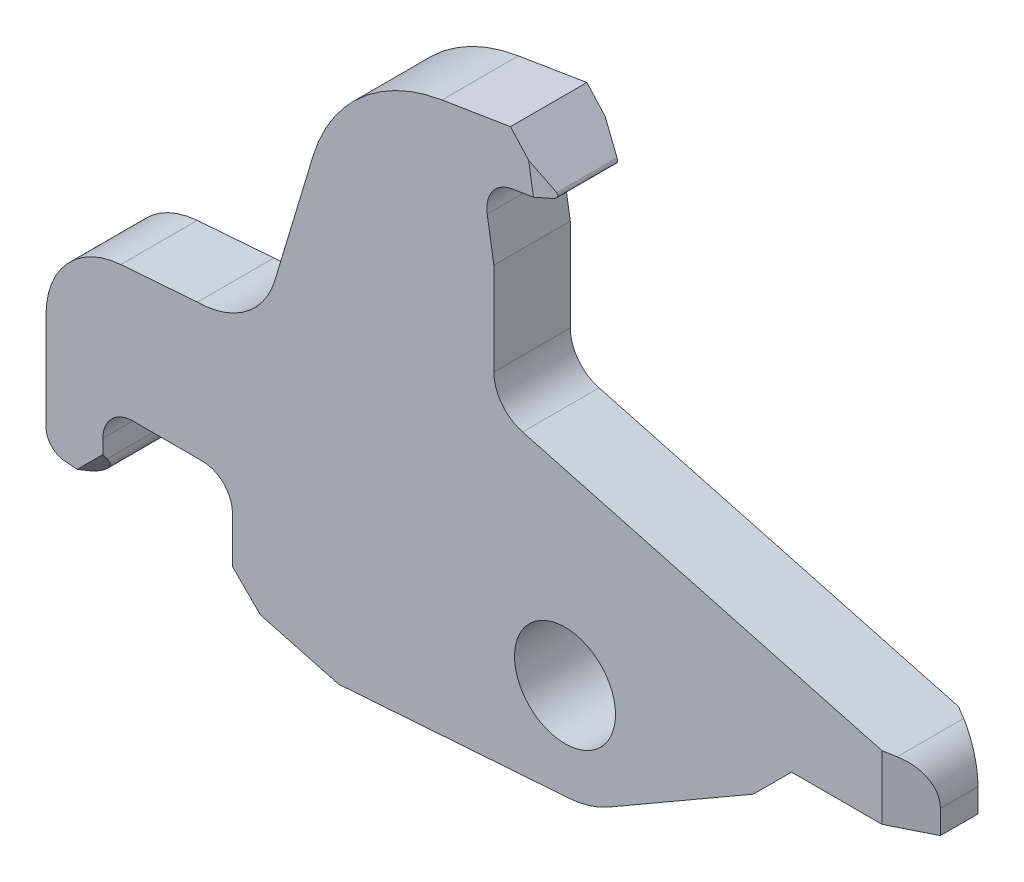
ISO-10303-21;
HEADER;
FILE_DESCRIPTION(('STEP AP214'),'2;1');
FILE_NAME('part.step','',(''),(''),'','','');
FILE_SCHEMA(('AUTOMOTIVE_DESIGN { 1 0 10303 214 1 1 1 1 }'));
ENDSEC;
DATA;
#1=APPLICATION_CONTEXT('core data for automotive mechanical design processes');
#2=APPLICATION_PROTOCOL_DEFINITION('international standard','automotive_design',2000,#1);
#3=PRODUCT_CONTEXT('',#1,'mechanical');
#4=PRODUCT('Part','Part','',(#3));
#5=PRODUCT_RELATED_PRODUCT_CATEGORY('part','',(#4));
#6=PRODUCT_DEFINITION_FORMATION('','',#4);
#7=PRODUCT_DEFINITION_CONTEXT('part definition',#1,'design');
#8=PRODUCT_DEFINITION('design','',#6,#7);
#9=PRODUCT_DEFINITION_SHAPE('','',#8);
#10=(LENGTH_UNIT() NAMED_UNIT(*) SI_UNIT(.MILLI.,.METRE.));
#11=(NAMED_UNIT(*) PLANE_ANGLE_UNIT() SI_UNIT($,.RADIAN.));
#12=(NAMED_UNIT(*) SI_UNIT($,.STERADIAN.) SOLID_ANGLE_UNIT());
#13=UNCERTAINTY_MEASURE_WITH_UNIT(LENGTH_MEASURE(1.E-05),#10,'distance_accuracy_value','');
#14=(GEOMETRIC_REPRESENTATION_CONTEXT(3) GLOBAL_UNCERTAINTY_ASSIGNED_CONTEXT((#13)) GLOBAL_UNIT_ASSIGNED_CONTEXT((#10,
#11,#12)) REPRESENTATION_CONTEXT('',''));
#15=CARTESIAN_POINT('',(0.,0.,0.));
#16=DIRECTION('',(0.,0.,1.));
#17=DIRECTION('',(1.,0.,0.));
#18=AXIS2_PLACEMENT_3D('',#15,#16,#17);
#19=CARTESIAN_POINT('',(-18.923,-1.45184824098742,0.));
#20=DIRECTION('',(0.,0.,-1.));
#21=DIRECTION('',(0.923879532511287,-0.382683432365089,0.));
#22=AXIS2_PLACEMENT_3D('',#19,#20,#21);
#23=CYLINDRICAL_SURFACE('',#22,0.7874);
#24=CARTESIAN_POINT('',(-18.923,-1.45184824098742,-0.392048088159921));
#25=DIRECTION('',(-0.5,0.5,0.707106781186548));
#26=DIRECTION('',(0.5,-0.5,0.707106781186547));
#27=AXIS2_PLACEMENT_3D('',#24,#25,#26);
#28=ELLIPSE('',#27,1.11355175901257,0.7874);
#29=CARTESIAN_POINT('',(-18.3662241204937,-2.0086241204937,0.395351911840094));
#30=VERTEX_POINT('',#29);
#31=CARTESIAN_POINT('',(-18.1356,-1.45184824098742,0.164727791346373));
#32=VERTEX_POINT('',#31);
#33=EDGE_CURVE('E11',#30,#32,#28,.T.);
#34=ORIENTED_EDGE('',*,*,#33,.T.);
#35=DIRECTION('',(0.,0.,1.));
#36=VECTOR('',#35,1.);
#37=CARTESIAN_POINT('',(-18.1356,-1.45184824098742,0.));
#38=LINE('',#37,#36);
#39=CARTESIAN_POINT('',(-18.1356,-1.45184824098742,2.83527220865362));
#40=VERTEX_POINT('',#39);
#41=EDGE_CURVE('E27',#32,#40,#38,.T.);
#42=ORIENTED_EDGE('',*,*,#41,.T.);
#43=CARTESIAN_POINT('',(-18.923,-1.45184824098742,3.3920480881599));
#44=DIRECTION('',(-0.5,0.5,-0.707106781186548));
#45=DIRECTION('',(0.5,-0.5,-0.707106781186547));
#46=AXIS2_PLACEMENT_3D('',#43,#44,#45);
#47=ELLIPSE('',#46,1.11355175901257,0.7874);
#48=CARTESIAN_POINT('',(-18.3662241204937,-2.0086241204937,2.6046480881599));
#49=VERTEX_POINT('',#48);
#50=EDGE_CURVE('E458',#40,#49,#47,.T.);
#51=ORIENTED_EDGE('',*,*,#50,.T.);
#52=DIRECTION('',(0.,0.,-1.));
#53=VECTOR('',#52,1.);
#54=CARTESIAN_POINT('',(-18.3662241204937,-2.0086241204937,0.));
#55=LINE('',#54,#53);
#56=EDGE_CURVE('E462',#49,#30,#55,.T.);
#57=ORIENTED_EDGE('',*,*,#56,.T.);
#58=EDGE_LOOP('',(#34,#42,#51,#57));
#59=FACE_BOUND('',#58,.T.);
#60=ADVANCED_FACE('F16',(#59),#23,.T.);
#61=CARTESIAN_POINT('',(-18.620230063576,-2.26263006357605,0.));
#62=DIRECTION('',(-0.707106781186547,0.707106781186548,0.));
#63=DIRECTION('',(0.,0.,1.));
#64=AXIS2_PLACEMENT_3D('',#61,#62,#63);
#65=PLANE('',#64);
#66=ORIENTED_EDGE('',*,*,#56,.F.);
#67=DIRECTION('',(0.707106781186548,0.707106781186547,0.));
#68=VECTOR('',#67,1.);
#69=CARTESIAN_POINT('',(-18.5075447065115,-2.1499447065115,2.6046480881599));
#70=LINE('',#69,#68);
#71=CARTESIAN_POINT('',(-18.3664926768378,-2.00889267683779,2.6046480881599));
#72=VERTEX_POINT('',#71);
#73=EDGE_CURVE('E690',#72,#49,#70,.T.);
#74=ORIENTED_EDGE('',*,*,#73,.F.);
#75=DIRECTION('',(0.,0.,1.));
#76=VECTOR('',#75,1.);
#77=CARTESIAN_POINT('',(-18.3664926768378,-2.00889267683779,0.));
#78=LINE('',#77,#76);
#79=CARTESIAN_POINT('',(-18.3664926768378,-2.00889267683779,0.395351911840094));
#80=VERTEX_POINT('',#79);
#81=EDGE_CURVE('E737',#80,#72,#78,.T.);
#82=ORIENTED_EDGE('',*,*,#81,.F.);
#83=DIRECTION('',(-0.707106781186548,-0.707106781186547,0.));
#84=VECTOR('',#83,1.);
#85=CARTESIAN_POINT('',(-18.5075447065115,-2.1499447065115,0.395351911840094));
#86=LINE('',#85,#84);
#87=EDGE_CURVE('E622',#30,#80,#86,.T.);
#88=ORIENTED_EDGE('',*,*,#87,.F.);
#89=EDGE_LOOP('',(#66,#74,#82,#88));
#90=FACE_BOUND('',#89,.T.);
#91=ADVANCED_FACE('F1203',(#90),#65,.F.);
#92=CARTESIAN_POINT('',(-18.6744153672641,-1.75770333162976,3.));
#93=DIRECTION('',(0.5,-0.5,0.707106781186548));
#94=DIRECTION('',(-0.707106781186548,-0.707106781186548,0.));
#95=AXIS2_PLACEMENT_3D('',#92,#93,#94);
#96=PLANE('',#95);
#97=ORIENTED_EDGE('',*,*,#50,.F.);
#98=DIRECTION('',(0.,-0.816496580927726,-0.577350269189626));
#99=VECTOR('',#98,1.);
#100=CARTESIAN_POINT('',(-18.1356,-2.46481011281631,2.119));
#101=LINE('',#100,#99);
#102=CARTESIAN_POINT('',(-18.1356,-1.21888796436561,3.));
#103=VERTEX_POINT('',#102);
#104=EDGE_CURVE('E379',#103,#40,#101,.T.);
#105=ORIENTED_EDGE('',*,*,#104,.F.);
#106=DIRECTION('',(0.707106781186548,0.707106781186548,0.));
#107=VECTOR('',#106,1.);
#108=CARTESIAN_POINT('',(-14.5919285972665,2.32478343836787,3.));
#109=LINE('',#108,#107);
#110=CARTESIAN_POINT('',(-19.1428004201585,-2.22608838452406,3.));
#111=VERTEX_POINT('',#110);
#112=EDGE_CURVE('E579',#111,#103,#109,.T.);
#113=ORIENTED_EDGE('',*,*,#112,.F.);
#114=DIRECTION('',(-0.796247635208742,0.0556790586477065,0.602403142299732));
#115=VECTOR('',#114,1.);
#116=CARTESIAN_POINT('',(-21.7349077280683,-2.04483058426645,4.96106527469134));
#117=LINE('',#116,#115);
#118=CARTESIAN_POINT('',(-18.9781948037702,-2.23759873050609,2.8754672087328));
#119=VERTEX_POINT('',#118);
#120=EDGE_CURVE('E507',#119,#111,#117,.T.);
#121=ORIENTED_EDGE('',*,*,#120,.F.);
#122=CARTESIAN_POINT('',(-18.9232685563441,-1.4521167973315,3.3920480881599));
#123=DIRECTION('',(-0.5,0.5,-0.707106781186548));
#124=DIRECTION('',(0.5,-0.5,-0.707106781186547));
#125=AXIS2_PLACEMENT_3D('',#122,#123,#124);
#126=ELLIPSE('',#125,1.11355175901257,0.7874);
#127=EDGE_CURVE('E753',#72,#119,#126,.T.);
#128=ORIENTED_EDGE('',*,*,#127,.F.);
#129=ORIENTED_EDGE('',*,*,#73,.T.);
#130=EDGE_LOOP('',(#97,#105,#113,#121,#128,#129));
#131=FACE_BOUND('',#130,.T.);
#132=ADVANCED_FACE('F875',(#131),#96,.T.);
#133=CARTESIAN_POINT('',(-18.9232685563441,-1.4521167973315,0.));
#134=DIRECTION('',(0.,0.,1.));
#135=DIRECTION('',(0.350207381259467,-0.936672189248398,0.));
#136=AXIS2_PLACEMENT_3D('',#133,#134,#135);
#137=CYLINDRICAL_SURFACE('',#136,0.7874);
#138=ORIENTED_EDGE('',*,*,#127,.T.);
#139=DIRECTION('',(0.,0.,-1.));
#140=VECTOR('',#139,1.);
#141=CARTESIAN_POINT('',(-18.9781948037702,-2.23759873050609,0.));
#142=LINE('',#141,#140);
#143=CARTESIAN_POINT('',(-18.9781948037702,-2.23759873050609,0.124532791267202));
#144=VERTEX_POINT('',#143);
#145=EDGE_CURVE('E736',#119,#144,#142,.T.);
#146=ORIENTED_EDGE('',*,*,#145,.T.);
#147=CARTESIAN_POINT('',(-18.9232685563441,-1.4521167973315,-0.392048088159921));
#148=DIRECTION('',(-0.5,0.5,0.707106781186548));
#149=DIRECTION('',(0.5,-0.5,0.707106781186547));
#150=AXIS2_PLACEMENT_3D('',#147,#148,#149);
#151=ELLIPSE('',#150,1.11355175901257,0.7874);
#152=EDGE_CURVE('E732',#144,#80,#151,.T.);
#153=ORIENTED_EDGE('',*,*,#152,.T.);
#154=ORIENTED_EDGE('',*,*,#81,.T.);
#155=EDGE_LOOP('',(#138,#146,#153,#154));
#156=FACE_BOUND('',#155,.T.);
#157=ADVANCED_FACE('F1192',(#156),#137,.T.);
#158=CARTESIAN_POINT('',(-19.5832,-1.40596989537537,1.5));
#159=DIRECTION('',(0.,0.,-1.));
#160=DIRECTION('',(-0.731353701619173,-0.681998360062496,0.));
#161=AXIS2_PLACEMENT_3D('',#158,#159,#160);
#162=CYLINDRICAL_SURFACE('',#161,0.7874);
#163=CARTESIAN_POINT('',(-19.5832,-1.40596989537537,0.));
#164=DIRECTION('',(0.,0.,1.));
#165=DIRECTION('',(-0.731353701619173,-0.681998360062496,0.));
#166=AXIS2_PLACEMENT_3D('',#163,#164,#165);
#167=CIRCLE('',#166,0.7874);
#168=CARTESIAN_POINT('',(-20.3706,-1.40596989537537,0.));
#169=VERTEX_POINT('',#168);
#170=CARTESIAN_POINT('',(-19.6381262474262,-2.19145182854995,0.));
#171=VERTEX_POINT('',#170);
#172=EDGE_CURVE('E467',#169,#171,#167,.T.);
#173=ORIENTED_EDGE('',*,*,#172,.T.);
#174=DIRECTION('',(0.,0.,1.));
#175=VECTOR('',#174,1.);
#176=CARTESIAN_POINT('',(-19.6381262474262,-2.19145182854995,1.5));
#177=LINE('',#176,#175);
#178=CARTESIAN_POINT('',(-19.6381262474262,-2.19145182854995,3.));
#179=VERTEX_POINT('',#178);
#180=EDGE_CURVE('E463',#171,#179,#177,.T.);
#181=ORIENTED_EDGE('',*,*,#180,.T.);
#182=CARTESIAN_POINT('',(-19.5832,-1.40596989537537,3.));
#183=DIRECTION('',(0.,0.,-1.));
#184=DIRECTION('',(-0.731353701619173,-0.681998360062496,0.));
#185=AXIS2_PLACEMENT_3D('',#182,#183,#184);
#186=CIRCLE('',#185,0.7874);
#187=CARTESIAN_POINT('',(-20.3706,-1.40596989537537,3.));
#188=VERTEX_POINT('',#187);
#189=EDGE_CURVE('E468',#179,#188,#186,.T.);
#190=ORIENTED_EDGE('',*,*,#189,.T.);
#191=DIRECTION('',(0.,0.,-1.));
#192=VECTOR('',#191,1.);
#193=CARTESIAN_POINT('',(-20.3706,-1.40596989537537,1.5));
#194=LINE('',#193,#192);
#195=EDGE_CURVE('E578',#188,#169,#194,.T.);
#196=ORIENTED_EDGE('',*,*,#195,.T.);
#197=EDGE_LOOP('',(#173,#181,#190,#196));
#198=FACE_BOUND('',#197,.T.);
#199=ADVANCED_FACE('F866',(#198),#162,.T.);
#200=CARTESIAN_POINT('',(-20.3706,6.36164937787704,3.));
#201=DIRECTION('',(1.,0.,0.));
#202=DIRECTION('',(0.,1.,0.));
#203=AXIS2_PLACEMENT_3D('',#200,#201,#202);
#204=PLANE('',#203);
#205=ORIENTED_EDGE('',*,*,#195,.F.);
#206=DIRECTION('',(0.,-1.,0.));
#207=VECTOR('',#206,1.);
#208=CARTESIAN_POINT('',(-20.3706,5.09697326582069,3.));
#209=LINE('',#208,#207);
#210=CARTESIAN_POINT('',(-20.3706,2.42291854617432,3.));
#211=VERTEX_POINT('',#210);
#212=EDGE_CURVE('E546',#211,#188,#209,.T.);
#213=ORIENTED_EDGE('',*,*,#212,.F.);
#214=DIRECTION('',(0.,0.,1.));
#215=VECTOR('',#214,1.);
#216=CARTESIAN_POINT('',(-20.3706,2.42291854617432,1.5));
#217=LINE('',#216,#215);
#218=CARTESIAN_POINT('',(-20.3706,2.42291854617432,0.));
#219=VERTEX_POINT('',#218);
#220=EDGE_CURVE('E453',#219,#211,#217,.T.);
#221=ORIENTED_EDGE('',*,*,#220,.F.);
#222=DIRECTION('',(0.,1.,0.));
#223=VECTOR('',#222,1.);
#224=CARTESIAN_POINT('',(-20.3706,5.09697326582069,0.));
#225=LINE('',#224,#223);
#226=EDGE_CURVE('E472',#169,#219,#225,.T.);
#227=ORIENTED_EDGE('',*,*,#226,.F.);
#228=EDGE_LOOP('',(#205,#213,#221,#227));
#229=FACE_BOUND('',#228,.T.);
#230=ADVANCED_FACE('F862',(#229),#204,.F.);
#231=CARTESIAN_POINT('',(-7.93446877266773,3.83229715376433,3.));
#232=DIRECTION('',(0.,0.,1.));
#233=DIRECTION('',(1.,0.,0.));
#234=AXIS2_PLACEMENT_3D('',#231,#232,#233);
#235=PLANE('',#234);
#236=ORIENTED_EDGE('',*,*,#189,.F.);
#237=DIRECTION('',(0.997564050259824,-0.0697564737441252,0.));
#238=VECTOR('',#237,1.);
#239=CARTESIAN_POINT('',(-29.972,-1.46883698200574,3.));
#240=LINE('',#239,#238);
#241=EDGE_CURVE('E574',#179,#111,#240,.T.);
#242=ORIENTED_EDGE('',*,*,#241,.T.);
#243=ORIENTED_EDGE('',*,*,#112,.T.);
#244=DIRECTION('',(0.,1.,0.));
#245=VECTOR('',#244,1.);
#246=CARTESIAN_POINT('',(-18.1356,-2.2965186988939,3.));
#247=LINE('',#246,#245);
#248=CARTESIAN_POINT('',(-18.1356,-0.6604,3.));
#249=VERTEX_POINT('',#248);
#250=EDGE_CURVE('E600',#103,#249,#247,.T.);
#251=ORIENTED_EDGE('',*,*,#250,.T.);
#252=CARTESIAN_POINT('',(-16.9672,-0.6604,3.));
#253=DIRECTION('',(0.,0.,-1.));
#254=DIRECTION('',(0.,-1.,0.));
#255=AXIS2_PLACEMENT_3D('',#252,#253,#254);
#256=CIRCLE('',#255,1.1684);
#257=CARTESIAN_POINT('',(-16.9672,0.508,3.));
#258=VERTEX_POINT('',#257);
#259=EDGE_CURVE('E595',#249,#258,#256,.T.);
#260=ORIENTED_EDGE('',*,*,#259,.T.);
#261=DIRECTION('',(1.,0.,0.));
#262=VECTOR('',#261,1.);
#263=CARTESIAN_POINT('',(-16.9672,0.508,3.));
#264=LINE('',#263,#262);
#265=CARTESIAN_POINT('',(-14.224,0.508,3.));
#266=VERTEX_POINT('',#265);
#267=EDGE_CURVE('E531',#258,#266,#264,.T.);
#268=ORIENTED_EDGE('',*,*,#267,.T.);
#269=CARTESIAN_POINT('',(-14.224,-0.6604,3.));
#270=DIRECTION('',(0.,0.,-1.));
#271=DIRECTION('',(-1.,0.,0.));
#272=AXIS2_PLACEMENT_3D('',#269,#270,#271);
#273=CIRCLE('',#272,1.1684);
#274=CARTESIAN_POINT('',(-13.0556,-0.6604,3.));
#275=VERTEX_POINT('',#274);
#276=EDGE_CURVE('E527',#266,#275,#273,.T.);
#277=ORIENTED_EDGE('',*,*,#276,.T.);
#278=DIRECTION('',(0.,-1.,0.));
#279=VECTOR('',#278,1.);
#280=CARTESIAN_POINT('',(-13.0556,0.,3.));
#281=LINE('',#280,#279);
#282=CARTESIAN_POINT('',(-13.0556,-2.48176757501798,3.));
#283=VERTEX_POINT('',#282);
#284=EDGE_CURVE('E499',#275,#283,#281,.T.);
#285=ORIENTED_EDGE('',*,*,#284,.T.);
#286=DIRECTION('',(0.707106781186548,-0.707106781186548,0.));
#287=VECTOR('',#286,1.);
#288=CARTESIAN_POINT('',(-13.0556,-2.48176757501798,3.));
#289=LINE('',#288,#287);
#290=CARTESIAN_POINT('',(-11.9568144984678,-3.58055307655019,3.));
#291=VERTEX_POINT('',#290);
#292=EDGE_CURVE('E495',#283,#291,#289,.T.);
#293=ORIENTED_EDGE('',*,*,#292,.T.);
#294=DIRECTION('',(0.965925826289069,-0.25881904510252,0.));
#295=VECTOR('',#294,1.);
#296=CARTESIAN_POINT('',(-11.9568144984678,-3.58055307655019,3.));
#297=LINE('',#296,#295);
#298=CARTESIAN_POINT('',(-8.89,-4.40230354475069,3.));
#299=VERTEX_POINT('',#298);
#300=EDGE_CURVE('E500',#291,#299,#297,.T.);
#301=ORIENTED_EDGE('',*,*,#300,.T.);
#302=DIRECTION('',(0.997451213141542,0.0713517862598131,0.));
#303=VECTOR('',#302,1.);
#304=CARTESIAN_POINT('',(-8.89,-4.40230354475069,3.));
#305=LINE('',#304,#303);
#306=CARTESIAN_POINT('',(0.174712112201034,-3.7538674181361,3.));
#307=VERTEX_POINT('',#306);
#308=EDGE_CURVE('E591',#299,#307,#305,.T.);
#309=ORIENTED_EDGE('',*,*,#308,.T.);
#310=CARTESIAN_POINT('',(-0.079014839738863,-0.206930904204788,3.));
#311=DIRECTION('',(0.,0.,1.));
#312=DIRECTION('',(0.0713517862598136,-0.997451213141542,0.));
#313=AXIS2_PLACEMENT_3D('',#310,#311,#312);
#314=CIRCLE('',#313,3.556);
#315=CARTESIAN_POINT('',(1.69898516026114,-3.28651724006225,3.));
#316=VERTEX_POINT('',#315);
#317=EDGE_CURVE('E638',#307,#316,#314,.T.);
#318=ORIENTED_EDGE('',*,*,#317,.T.);
#319=DIRECTION('',(0.866025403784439,0.5,0.));
#320=VECTOR('',#319,1.);
#321=CARTESIAN_POINT('',(1.69898516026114,-3.28651724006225,3.));
#322=LINE('',#321,#320);
#323=CARTESIAN_POINT('',(7.3914,0.,3.));
#324=VERTEX_POINT('',#323);
#325=EDGE_CURVE('E642',#316,#324,#322,.T.);
#326=ORIENTED_EDGE('',*,*,#325,.T.);
#327=DIRECTION('',(0.707106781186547,0.707106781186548,0.));
#328=VECTOR('',#327,1.);
#329=CARTESIAN_POINT('',(7.3914,0.,3.));
#330=LINE('',#329,#328);
#331=CARTESIAN_POINT('',(8.89,1.4986,3.));
#332=VERTEX_POINT('',#331);
#333=EDGE_CURVE('E479',#324,#332,#330,.T.);
#334=ORIENTED_EDGE('',*,*,#333,.T.);
#335=DIRECTION('',(1.,0.,0.));
#336=VECTOR('',#335,1.);
#337=CARTESIAN_POINT('',(8.89,1.4986,3.));
#338=LINE('',#337,#336);
#339=CARTESIAN_POINT('',(12.446,1.4986,3.));
#340=VERTEX_POINT('',#339);
#341=EDGE_CURVE('E475',#332,#340,#338,.T.);
#342=ORIENTED_EDGE('',*,*,#341,.T.);
#343=DIRECTION('',(0.,1.,0.));
#344=VECTOR('',#343,1.);
#345=CARTESIAN_POINT('',(12.446,1.91614857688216,3.));
#346=LINE('',#345,#344);
#347=CARTESIAN_POINT('',(12.446,4.00169253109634,3.));
#348=VERTEX_POINT('',#347);
#349=EDGE_CURVE('E480',#340,#348,#346,.T.);
#350=ORIENTED_EDGE('',*,*,#349,.T.);
#351=DIRECTION('',(-0.965925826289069,0.25881904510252,0.));
#352=VECTOR('',#351,1.);
#353=CARTESIAN_POINT('',(12.8404402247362,3.89600259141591,3.));
#354=LINE('',#353,#352);
#355=CARTESIAN_POINT('',(-1.66444022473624,7.78257359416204,3.));
#356=VERTEX_POINT('',#355);
#357=EDGE_CURVE('E493',#348,#356,#354,.T.);
#358=ORIENTED_EDGE('',*,*,#357,.T.);
#359=CARTESIAN_POINT('',(-1.27,9.25464455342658,3.));
#360=DIRECTION('',(0.,0.,-1.));
#361=DIRECTION('',(1.,0.,0.));
#362=AXIS2_PLACEMENT_3D('',#359,#360,#361);
#363=CIRCLE('',#362,1.524);
#364=CARTESIAN_POINT('',(-2.794,9.25464455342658,3.));
#365=VERTEX_POINT('',#364);
#366=EDGE_CURVE('E489',#356,#365,#363,.T.);
#367=ORIENTED_EDGE('',*,*,#366,.T.);
#368=DIRECTION('',(0.,1.,0.));
#369=VECTOR('',#368,1.);
#370=CARTESIAN_POINT('',(-2.794,9.25464455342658,3.));
#371=LINE('',#370,#369);
#372=CARTESIAN_POINT('',(-2.794,12.8893541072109,3.));
#373=VERTEX_POINT('',#372);
#374=EDGE_CURVE('E494',#365,#373,#371,.T.);
#375=ORIENTED_EDGE('',*,*,#374,.T.);
#376=DIRECTION('',(-0.160742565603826,0.986996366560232,0.));
#377=VECTOR('',#376,1.);
#378=CARTESIAN_POINT('',(-2.794,12.8893541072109,3.));
#379=LINE('',#378,#377);
#380=CARTESIAN_POINT('',(-3.05560321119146,14.4956580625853,3.));
#381=VERTEX_POINT('',#380);
#382=EDGE_CURVE('E523',#373,#381,#379,.T.);
#383=ORIENTED_EDGE('',*,*,#382,.T.);
#384=CARTESIAN_POINT('',(-1.90239665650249,14.6834696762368,3.));
#385=DIRECTION('',(0.,0.,-1.));
#386=DIRECTION('',(0.160742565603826,-0.986996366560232,0.));
#387=AXIS2_PLACEMENT_3D('',#384,#385,#386);
#388=CIRCLE('',#387,1.1684);
#389=CARTESIAN_POINT('',(-2.09020827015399,15.8366762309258,3.));
#390=VERTEX_POINT('',#389);
#391=EDGE_CURVE('E658',#381,#390,#388,.T.);
#392=ORIENTED_EDGE('',*,*,#391,.T.);
#393=DIRECTION('',(0.986996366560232,0.160742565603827,0.));
#394=VECTOR('',#393,1.);
#395=CARTESIAN_POINT('',(-2.09020827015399,15.8366762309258,3.));
#396=LINE('',#395,#394);
#397=CARTESIAN_POINT('',(-1.23783820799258,15.9754935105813,3.));
#398=VERTEX_POINT('',#397);
#399=EDGE_CURVE('E88',#390,#398,#396,.T.);
#400=ORIENTED_EDGE('',*,*,#399,.T.);
#401=DIRECTION('',(-0.160742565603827,0.986996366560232,0.));
#402=VECTOR('',#401,1.);
#403=CARTESIAN_POINT('',(-0.361079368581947,10.5919923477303,3.));
#404=LINE('',#403,#402);
#405=CARTESIAN_POINT('',(-1.42644985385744,17.1336124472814,3.));
#406=VERTEX_POINT('',#405);
#407=EDGE_CURVE('E105',#398,#406,#404,.T.);
#408=ORIENTED_EDGE('',*,*,#407,.T.);
#409=DIRECTION('',(-0.672366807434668,0.740218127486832,0.));
#410=VECTOR('',#409,1.);
#411=CARTESIAN_POINT('',(-0.485746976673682,16.0979793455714,3.));
#412=LINE('',#411,#410);
#413=CARTESIAN_POINT('',(-2.14232431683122,17.9217287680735,3.));
#414=VERTEX_POINT('',#413);
#415=EDGE_CURVE('E409',#406,#414,#412,.T.);
#416=ORIENTED_EDGE('',*,*,#415,.T.);
#417=DIRECTION('',(-0.98705275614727,-0.160395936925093,0.));
#418=VECTOR('',#417,1.);
#419=CARTESIAN_POINT('',(-2.14232431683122,17.9217287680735,3.));
#420=LINE('',#419,#418);
#421=CARTESIAN_POINT('',(-4.82851419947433,17.4852232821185,3.));
#422=VERTEX_POINT('',#421);
#423=EDGE_CURVE('E399',#414,#422,#420,.T.);
#424=ORIENTED_EDGE('',*,*,#423,.T.);
#425=CARTESIAN_POINT('',(-3.81,11.2174382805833,3.));
#426=DIRECTION('',(0.,0.,1.));
#427=DIRECTION('',(-0.160395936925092,0.98705275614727,0.));
#428=AXIS2_PLACEMENT_3D('',#425,#426,#427);
#429=CIRCLE('',#428,6.35);
#430=CARTESIAN_POINT('',(-9.89049058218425,13.0477754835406,3.));
#431=VERTEX_POINT('',#430);
#432=EDGE_CURVE('E396',#422,#431,#429,.T.);
#433=ORIENTED_EDGE('',*,*,#432,.T.);
#434=DIRECTION('',(-0.288242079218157,-0.957557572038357,0.));
#435=VECTOR('',#434,1.);
#436=CARTESIAN_POINT('',(-9.89049058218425,13.0477754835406,3.));
#437=LINE('',#436,#435);
#438=CARTESIAN_POINT('',(-11.3869547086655,8.07643139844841,3.));
#439=VERTEX_POINT('',#438);
#440=EDGE_CURVE('E400',#431,#439,#437,.T.);
#441=ORIENTED_EDGE('',*,*,#440,.T.);
#442=CARTESIAN_POINT('',(-14.4272,8.9916,3.));
#443=DIRECTION('',(0.,0.,-1.));
#444=DIRECTION('',(0.,1.,0.));
#445=AXIS2_PLACEMENT_3D('',#442,#443,#444);
#446=CIRCLE('',#445,3.17499999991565);
#447=CARTESIAN_POINT('',(-14.4272,5.8166,3.));
#448=VERTEX_POINT('',#447);
#449=EDGE_CURVE('E411',#439,#448,#446,.T.);
#450=ORIENTED_EDGE('',*,*,#449,.T.);
#451=DIRECTION('',(-0.99714627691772,-0.075493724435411,0.));
#452=VECTOR('',#451,1.);
#453=CARTESIAN_POINT('',(-14.4272,5.8166,3.));
#454=LINE('',#453,#452);
#455=CARTESIAN_POINT('',(-17.4352925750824,5.58885797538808,3.));
#456=VERTEX_POINT('',#455);
#457=EDGE_CURVE('E418',#448,#456,#454,.T.);
#458=ORIENTED_EDGE('',*,*,#457,.T.);
#459=CARTESIAN_POINT('',(-17.1956,2.42291854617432,3.));
#460=DIRECTION('',(0.,0.,-1.));
#461=DIRECTION('',(-0.733312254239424,0.67989200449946,0.));
#462=AXIS2_PLACEMENT_3D('',#459,#460,#461);
#463=CIRCLE('',#462,3.175);
#464=EDGE_CURVE('E699',#211,#456,#463,.T.);
#465=ORIENTED_EDGE('',*,*,#464,.F.);
#466=ORIENTED_EDGE('',*,*,#212,.T.);
#467=EDGE_LOOP('',(#236,#242,#243,#251,#260,#268,#277,#285,#293,#301,#309,#318,#326,#334,#342,
#350,#358,#367,#375,#383,#392,#400,#408,#416,#424,#433,#441,#450,#458,#465,#466));
#468=FACE_BOUND('',#467,.T.);
#469=CARTESIAN_POINT('',(0.,0.,3.));
#470=DIRECTION('',(0.,0.,-1.));
#471=DIRECTION('',(-1.,0.,0.));
#472=AXIS2_PLACEMENT_3D('',#469,#470,#471);
#473=CIRCLE('',#472,1.9812);
#474=CARTESIAN_POINT('',(1.9812,0.,3.));
#475=VERTEX_POINT('',#474);
#476=EDGE_CURVE('E550',#475,#475,#473,.T.);
#477=ORIENTED_EDGE('',*,*,#476,.T.);
#478=EDGE_LOOP('',(#477));
#479=FACE_BOUND('',#478,.T.);
#480=ADVANCED_FACE('F792',(#468,#479),#235,.T.);
#481=CARTESIAN_POINT('',(-17.1956,2.42291854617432,1.5));
#482=DIRECTION('',(0.,0.,1.));
#483=DIRECTION('',(-0.733312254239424,0.67989200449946,0.));
#484=AXIS2_PLACEMENT_3D('',#481,#482,#483);
#485=CYLINDRICAL_SURFACE('',#484,3.175);
#486=ORIENTED_EDGE('',*,*,#464,.T.);
#487=DIRECTION('',(0.,0.,-1.));
#488=VECTOR('',#487,1.);
#489=CARTESIAN_POINT('',(-17.4352925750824,5.58885797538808,1.5));
#490=LINE('',#489,#488);
#491=CARTESIAN_POINT('',(-17.4352925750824,5.58885797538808,0.));
#492=VERTEX_POINT('',#491);
#493=EDGE_CURVE('E452',#456,#492,#490,.T.);
#494=ORIENTED_EDGE('',*,*,#493,.T.);
#495=CARTESIAN_POINT('',(-17.1956,2.42291854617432,0.));
#496=DIRECTION('',(0.,0.,1.));
#497=DIRECTION('',(-0.733312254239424,0.67989200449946,0.));
#498=AXIS2_PLACEMENT_3D('',#495,#496,#497);
#499=CIRCLE('',#498,3.175);
#500=EDGE_CURVE('E448',#492,#219,#499,.T.);
#501=ORIENTED_EDGE('',*,*,#500,.T.);
#502=ORIENTED_EDGE('',*,*,#220,.T.);
#503=EDGE_LOOP('',(#486,#494,#501,#502));
#504=FACE_BOUND('',#503,.T.);
#505=ADVANCED_FACE('F857',(#504),#485,.T.);
#506=CARTESIAN_POINT('',(-7.93446877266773,3.83229715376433,0.));
#507=DIRECTION('',(0.,0.,1.));
#508=DIRECTION('',(1.,0.,0.));
#509=AXIS2_PLACEMENT_3D('',#506,#507,#508);
#510=PLANE('',#509);
#511=ORIENTED_EDGE('',*,*,#172,.F.);
#512=ORIENTED_EDGE('',*,*,#226,.T.);
#513=ORIENTED_EDGE('',*,*,#500,.F.);
#514=DIRECTION('',(-0.99714627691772,-0.075493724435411,0.));
#515=VECTOR('',#514,1.);
#516=CARTESIAN_POINT('',(-14.4272,5.8166,0.));
#517=LINE('',#516,#515);
#518=CARTESIAN_POINT('',(-14.4272,5.8166,0.));
#519=VERTEX_POINT('',#518);
#520=EDGE_CURVE('E360',#519,#492,#517,.T.);
#521=ORIENTED_EDGE('',*,*,#520,.F.);
#522=CARTESIAN_POINT('',(-14.4272,8.9916,0.));
#523=DIRECTION('',(0.,0.,-1.));
#524=DIRECTION('',(0.,1.,0.));
#525=AXIS2_PLACEMENT_3D('',#522,#523,#524);
#526=CIRCLE('',#525,3.17499999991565);
#527=CARTESIAN_POINT('',(-11.3869547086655,8.07643139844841,0.));
#528=VERTEX_POINT('',#527);
#529=EDGE_CURVE('E501',#528,#519,#526,.T.);
#530=ORIENTED_EDGE('',*,*,#529,.F.);
#531=DIRECTION('',(-0.288242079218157,-0.957557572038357,0.));
#532=VECTOR('',#531,1.);
#533=CARTESIAN_POINT('',(-9.89049058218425,13.0477754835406,0.));
#534=LINE('',#533,#532);
#535=CARTESIAN_POINT('',(-9.89049058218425,13.0477754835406,0.));
#536=VERTEX_POINT('',#535);
#537=EDGE_CURVE('E517',#536,#528,#534,.T.);
#538=ORIENTED_EDGE('',*,*,#537,.F.);
#539=CARTESIAN_POINT('',(-3.81,11.2174382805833,0.));
#540=DIRECTION('',(0.,0.,1.));
#541=DIRECTION('',(-0.160395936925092,0.98705275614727,0.));
#542=AXIS2_PLACEMENT_3D('',#539,#540,#541);
#543=CIRCLE('',#542,6.35);
#544=CARTESIAN_POINT('',(-4.82851419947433,17.4852232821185,0.));
#545=VERTEX_POINT('',#544);
#546=EDGE_CURVE('E381',#545,#536,#543,.T.);
#547=ORIENTED_EDGE('',*,*,#546,.F.);
#548=DIRECTION('',(-0.98705275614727,-0.160395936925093,0.));
#549=VECTOR('',#548,1.);
#550=CARTESIAN_POINT('',(-2.14232431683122,17.9217287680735,0.));
#551=LINE('',#550,#549);
#552=CARTESIAN_POINT('',(-2.14232431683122,17.9217287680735,0.));
#553=VERTEX_POINT('',#552);
#554=EDGE_CURVE('E516',#553,#545,#551,.T.);
#555=ORIENTED_EDGE('',*,*,#554,.F.);
#556=DIRECTION('',(-0.672366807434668,0.740218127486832,0.));
#557=VECTOR('',#556,1.);
#558=CARTESIAN_POINT('',(-0.485746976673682,16.0979793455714,0.));
#559=LINE('',#558,#557);
#560=CARTESIAN_POINT('',(-1.42644985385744,17.1336124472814,0.));
#561=VERTEX_POINT('',#560);
#562=EDGE_CURVE('E560',#561,#553,#559,.T.);
#563=ORIENTED_EDGE('',*,*,#562,.F.);
#564=DIRECTION('',(0.160742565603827,-0.986996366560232,0.));
#565=VECTOR('',#564,1.);
#566=CARTESIAN_POINT('',(-0.361079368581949,10.5919923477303,0.));
#567=LINE('',#566,#565);
#568=CARTESIAN_POINT('',(-1.23783820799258,15.9754935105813,0.));
#569=VERTEX_POINT('',#568);
#570=EDGE_CURVE('E457',#561,#569,#567,.T.);
#571=ORIENTED_EDGE('',*,*,#570,.T.);
#572=DIRECTION('',(0.986996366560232,0.160742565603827,0.));
#573=VECTOR('',#572,1.);
#574=CARTESIAN_POINT('',(-2.09020827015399,15.8366762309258,0.));
#575=LINE('',#574,#573);
#576=CARTESIAN_POINT('',(-2.09020827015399,15.8366762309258,0.));
#577=VERTEX_POINT('',#576);
#578=EDGE_CURVE('E555',#577,#569,#575,.T.);
#579=ORIENTED_EDGE('',*,*,#578,.F.);
#580=CARTESIAN_POINT('',(-1.90239665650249,14.6834696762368,0.));
#581=DIRECTION('',(0.,0.,-1.));
#582=DIRECTION('',(0.160742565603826,-0.986996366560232,0.));
#583=AXIS2_PLACEMENT_3D('',#580,#581,#582);
#584=CIRCLE('',#583,1.1684);
#585=CARTESIAN_POINT('',(-3.05560321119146,14.4956580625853,0.));
#586=VERTEX_POINT('',#585);
#587=EDGE_CURVE('E610',#586,#577,#584,.T.);
#588=ORIENTED_EDGE('',*,*,#587,.F.);
#589=DIRECTION('',(-0.160742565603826,0.986996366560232,0.));
#590=VECTOR('',#589,1.);
#591=CARTESIAN_POINT('',(-2.794,12.8893541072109,0.));
#592=LINE('',#591,#590);
#593=CARTESIAN_POINT('',(-2.794,12.8893541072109,0.));
#594=VERTEX_POINT('',#593);
#595=EDGE_CURVE('E484',#594,#586,#592,.T.);
#596=ORIENTED_EDGE('',*,*,#595,.F.);
#597=DIRECTION('',(0.,1.,0.));
#598=VECTOR('',#597,1.);
#599=CARTESIAN_POINT('',(-2.794,9.25464455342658,0.));
#600=LINE('',#599,#598);
#601=CARTESIAN_POINT('',(-2.794,9.25464455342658,0.));
#602=VERTEX_POINT('',#601);
#603=EDGE_CURVE('E635',#602,#594,#600,.T.);
#604=ORIENTED_EDGE('',*,*,#603,.F.);
#605=CARTESIAN_POINT('',(-1.27,9.25464455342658,0.));
#606=DIRECTION('',(0.,0.,-1.));
#607=DIRECTION('',(1.,0.,0.));
#608=AXIS2_PLACEMENT_3D('',#605,#606,#607);
#609=CIRCLE('',#608,1.524);
#610=CARTESIAN_POINT('',(-1.66444022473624,7.78257359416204,0.));
#611=VERTEX_POINT('',#610);
#612=EDGE_CURVE('E545',#611,#602,#609,.T.);
#613=ORIENTED_EDGE('',*,*,#612,.F.);
#614=DIRECTION('',(-0.965925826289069,0.25881904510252,0.));
#615=VECTOR('',#614,1.);
#616=CARTESIAN_POINT('',(12.8404402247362,3.89600259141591,0.));
#617=LINE('',#616,#615);
#618=CARTESIAN_POINT('',(12.446,4.00169253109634,0.));
#619=VERTEX_POINT('',#618);
#620=EDGE_CURVE('E562',#619,#611,#617,.T.);
#621=ORIENTED_EDGE('',*,*,#620,.F.);
#622=DIRECTION('',(0.,-1.,0.));
#623=VECTOR('',#622,1.);
#624=CARTESIAN_POINT('',(12.446,1.91614857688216,0.));
#625=LINE('',#624,#623);
#626=CARTESIAN_POINT('',(12.446,1.4986,0.));
#627=VERTEX_POINT('',#626);
#628=EDGE_CURVE('E368',#619,#627,#625,.T.);
#629=ORIENTED_EDGE('',*,*,#628,.T.);
#630=DIRECTION('',(1.,0.,0.));
#631=VECTOR('',#630,1.);
#632=CARTESIAN_POINT('',(8.89,1.4986,0.));
#633=LINE('',#632,#631);
#634=CARTESIAN_POINT('',(8.89,1.4986,0.));
#635=VERTEX_POINT('',#634);
#636=EDGE_CURVE('E524',#635,#627,#633,.T.);
#637=ORIENTED_EDGE('',*,*,#636,.F.);
#638=DIRECTION('',(0.707106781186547,0.707106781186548,0.));
#639=VECTOR('',#638,1.);
#640=CARTESIAN_POINT('',(7.3914,0.,0.));
#641=LINE('',#640,#639);
#642=CARTESIAN_POINT('',(7.3914,0.,0.));
#643=VERTEX_POINT('',#642);
#644=EDGE_CURVE('E424',#643,#635,#641,.T.);
#645=ORIENTED_EDGE('',*,*,#644,.F.);
#646=DIRECTION('',(0.866025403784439,0.5,0.));
#647=VECTOR('',#646,1.);
#648=CARTESIAN_POINT('',(1.69898516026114,-3.28651724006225,0.));
#649=LINE('',#648,#647);
#650=CARTESIAN_POINT('',(1.69898516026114,-3.28651724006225,0.));
#651=VERTEX_POINT('',#650);
#652=EDGE_CURVE('E512',#651,#643,#649,.T.);
#653=ORIENTED_EDGE('',*,*,#652,.F.);
#654=CARTESIAN_POINT('',(-0.079014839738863,-0.206930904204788,0.));
#655=DIRECTION('',(0.,0.,1.));
#656=DIRECTION('',(0.0713517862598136,-0.997451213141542,0.));
#657=AXIS2_PLACEMENT_3D('',#654,#655,#656);
#658=CIRCLE('',#657,3.556);
#659=CARTESIAN_POINT('',(0.174712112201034,-3.7538674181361,0.));
#660=VERTEX_POINT('',#659);
#661=EDGE_CURVE('E513',#660,#651,#658,.T.);
#662=ORIENTED_EDGE('',*,*,#661,.F.);
#663=DIRECTION('',(0.997451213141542,0.0713517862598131,0.));
#664=VECTOR('',#663,1.);
#665=CARTESIAN_POINT('',(-8.89,-4.40230354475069,0.));
#666=LINE('',#665,#664);
#667=CARTESIAN_POINT('',(-8.89,-4.40230354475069,0.));
#668=VERTEX_POINT('',#667);
#669=EDGE_CURVE('E599',#668,#660,#666,.T.);
#670=ORIENTED_EDGE('',*,*,#669,.F.);
#671=DIRECTION('',(0.965925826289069,-0.25881904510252,0.));
#672=VECTOR('',#671,1.);
#673=CARTESIAN_POINT('',(-11.9568144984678,-3.58055307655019,0.));
#674=LINE('',#673,#672);
#675=CARTESIAN_POINT('',(-11.9568144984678,-3.58055307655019,0.));
#676=VERTEX_POINT('',#675);
#677=EDGE_CURVE('E433',#676,#668,#674,.T.);
#678=ORIENTED_EDGE('',*,*,#677,.F.);
#679=DIRECTION('',(0.707106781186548,-0.707106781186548,0.));
#680=VECTOR('',#679,1.);
#681=CARTESIAN_POINT('',(-13.0556,-2.48176757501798,0.));
#682=LINE('',#681,#680);
#683=CARTESIAN_POINT('',(-13.0556,-2.48176757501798,0.));
#684=VERTEX_POINT('',#683);
#685=EDGE_CURVE('E469',#684,#676,#682,.T.);
#686=ORIENTED_EDGE('',*,*,#685,.F.);
#687=DIRECTION('',(0.,-1.,0.));
#688=VECTOR('',#687,1.);
#689=CARTESIAN_POINT('',(-13.0556,0.,0.));
#690=LINE('',#689,#688);
#691=CARTESIAN_POINT('',(-13.0556,-0.6604,0.));
#692=VERTEX_POINT('',#691);
#693=EDGE_CURVE('E653',#692,#684,#690,.T.);
#694=ORIENTED_EDGE('',*,*,#693,.F.);
#695=CARTESIAN_POINT('',(-14.224,-0.6604,0.));
#696=DIRECTION('',(0.,0.,-1.));
#697=DIRECTION('',(-1.,0.,0.));
#698=AXIS2_PLACEMENT_3D('',#695,#696,#697);
#699=CIRCLE('',#698,1.1684);
#700=CARTESIAN_POINT('',(-14.224,0.508,0.));
#701=VERTEX_POINT('',#700);
#702=EDGE_CURVE('E611',#701,#692,#699,.T.);
#703=ORIENTED_EDGE('',*,*,#702,.F.);
#704=DIRECTION('',(1.,0.,0.));
#705=VECTOR('',#704,1.);
#706=CARTESIAN_POINT('',(-16.9672,0.508,0.));
#707=LINE('',#706,#705);
#708=CARTESIAN_POINT('',(-16.9672,0.508,0.));
#709=VERTEX_POINT('',#708);
#710=EDGE_CURVE('E386',#709,#701,#707,.T.);
#711=ORIENTED_EDGE('',*,*,#710,.F.);
#712=CARTESIAN_POINT('',(-16.9672,-0.6604,0.));
#713=DIRECTION('',(0.,0.,-1.));
#714=DIRECTION('',(0.,-1.,0.));
#715=AXIS2_PLACEMENT_3D('',#712,#713,#714);
#716=CIRCLE('',#715,1.1684);
#717=CARTESIAN_POINT('',(-18.1356,-0.6604,0.));
#718=VERTEX_POINT('',#717);
#719=EDGE_CURVE('E429',#718,#709,#716,.T.);
#720=ORIENTED_EDGE('',*,*,#719,.F.);
#721=DIRECTION('',(0.,1.,0.));
#722=VECTOR('',#721,1.);
#723=CARTESIAN_POINT('',(-18.1356,-2.2965186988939,0.));
#724=LINE('',#723,#722);
#725=CARTESIAN_POINT('',(-18.1356,-1.21888796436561,0.));
#726=VERTEX_POINT('',#725);
#727=EDGE_CURVE('E652',#726,#718,#724,.T.);
#728=ORIENTED_EDGE('',*,*,#727,.F.);
#729=DIRECTION('',(-0.707106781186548,-0.707106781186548,0.));
#730=VECTOR('',#729,1.);
#731=CARTESIAN_POINT('',(-14.5919285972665,2.32478343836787,0.));
#732=LINE('',#731,#730);
#733=CARTESIAN_POINT('',(-19.1428004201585,-2.22608838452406,0.));
#734=VERTEX_POINT('',#733);
#735=EDGE_CURVE('E359',#726,#734,#732,.T.);
#736=ORIENTED_EDGE('',*,*,#735,.T.);
#737=DIRECTION('',(0.997564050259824,-0.0697564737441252,0.));
#738=VECTOR('',#737,1.);
#739=CARTESIAN_POINT('',(-29.972,-1.46883698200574,0.));
#740=LINE('',#739,#738);
#741=EDGE_CURVE('E394',#171,#734,#740,.T.);
#742=ORIENTED_EDGE('',*,*,#741,.F.);
#743=EDGE_LOOP('',(#511,#512,#513,#521,#530,#538,#547,#555,#563,#571,#579,#588,#596,#604,#613,
#621,#629,#637,#645,#653,#662,#670,#678,#686,#694,#703,#711,#720,#728,#736,#742));
#744=FACE_BOUND('',#743,.T.);
#745=CARTESIAN_POINT('',(0.,0.,0.));
#746=DIRECTION('',(0.,0.,1.));
#747=DIRECTION('',(-1.,0.,0.));
#748=AXIS2_PLACEMENT_3D('',#745,#746,#747);
#749=CIRCLE('',#748,1.9812);
#750=CARTESIAN_POINT('',(1.9812,0.,0.));
#751=VERTEX_POINT('',#750);
#752=EDGE_CURVE('E354',#751,#751,#749,.T.);
#753=ORIENTED_EDGE('',*,*,#752,.T.);
#754=EDGE_LOOP('',(#753));
#755=FACE_BOUND('',#754,.T.);
#756=ADVANCED_FACE('F787',(#744,#755),#510,.F.);
#757=CARTESIAN_POINT('',(-14.4272,5.8166,0.));
#758=DIRECTION('',(-0.075493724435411,0.99714627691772,0.));
#759=DIRECTION('',(0.,0.,1.));
#760=AXIS2_PLACEMENT_3D('',#757,#758,#759);
#761=PLANE('',#760);
#762=ORIENTED_EDGE('',*,*,#493,.F.);
#763=ORIENTED_EDGE('',*,*,#457,.F.);
#764=DIRECTION('',(0.,0.,1.));
#765=VECTOR('',#764,1.);
#766=CARTESIAN_POINT('',(-14.4272,5.8166,0.));
#767=LINE('',#766,#765);
#768=EDGE_CURVE('E504',#519,#448,#767,.T.);
#769=ORIENTED_EDGE('',*,*,#768,.F.);
#770=ORIENTED_EDGE('',*,*,#520,.T.);
#771=EDGE_LOOP('',(#762,#763,#769,#770));
#772=FACE_BOUND('',#771,.T.);
#773=ADVANCED_FACE('F854',(#772),#761,.T.);
#774=CARTESIAN_POINT('',(-0.7370245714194,16.1857294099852,0.));
#775=DIRECTION('',(0.,0.,1.));
#776=DIRECTION('',(0.944089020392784,-0.329690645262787,0.));
#777=AXIS2_PLACEMENT_3D('',#774,#775,#776);
#778=CYLINDRICAL_SURFACE('',#777,0.127);
#779=CARTESIAN_POINT('',(-0.7370245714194,16.1857294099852,2.73595245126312));
#780=DIRECTION('',(-0.441398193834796,-0.0718862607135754,-0.894427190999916));
#781=DIRECTION('',(0.882796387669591,0.143772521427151,-0.447213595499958));
#782=AXIS2_PLACEMENT_3D('',#779,#780,#781);
#783=ELLIPSE('',#782,0.141990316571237,0.127);
#784=CARTESIAN_POINT('',(-0.643016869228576,16.2711199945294,2.6826968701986));
#785=VERTEX_POINT('',#784);
#786=CARTESIAN_POINT('',(-0.716610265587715,16.0603808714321,2.73595245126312));
#787=VERTEX_POINT('',#786);
#788=EDGE_CURVE('E371',#785,#787,#783,.T.);
#789=ORIENTED_EDGE('',*,*,#788,.T.);
#790=DIRECTION('',(0.,0.,-1.));
#791=VECTOR('',#790,1.);
#792=CARTESIAN_POINT('',(-0.716610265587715,16.0603808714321,0.));
#793=LINE('',#792,#791);
#794=CARTESIAN_POINT('',(-0.716610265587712,16.060380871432,0.264047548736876));
#795=VERTEX_POINT('',#794);
#796=EDGE_CURVE('E618',#787,#795,#793,.T.);
#797=ORIENTED_EDGE('',*,*,#796,.T.);
#798=CARTESIAN_POINT('',(-0.7370245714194,16.1857294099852,0.264047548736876));
#799=DIRECTION('',(-0.441398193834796,-0.0718862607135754,0.894427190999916));
#800=DIRECTION('',(0.882796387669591,0.143772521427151,0.447213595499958));
#801=AXIS2_PLACEMENT_3D('',#798,#799,#800);
#802=ELLIPSE('',#801,0.141990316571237,0.127);
#803=CARTESIAN_POINT('',(-0.643016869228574,16.2711199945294,0.317303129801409));
#804=VERTEX_POINT('',#803);
#805=EDGE_CURVE('E664',#795,#804,#802,.T.);
#806=ORIENTED_EDGE('',*,*,#805,.T.);
#807=DIRECTION('',(0.,0.,1.));
#808=VECTOR('',#807,1.);
#809=CARTESIAN_POINT('',(-0.643016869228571,16.2711199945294,0.));
#810=LINE('',#809,#808);
#811=EDGE_CURVE('E554',#804,#785,#810,.T.);
#812=ORIENTED_EDGE('',*,*,#811,.T.);
#813=EDGE_LOOP('',(#789,#797,#806,#812));
#814=FACE_BOUND('',#813,.T.);
#815=ADVANCED_FACE('F1358',(#814),#778,.T.);
#816=CARTESIAN_POINT('',(-2.09020827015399,15.8366762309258,0.));
#817=DIRECTION('',(0.160742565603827,-0.986996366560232,0.));
#818=DIRECTION('',(0.,0.,-1.));
#819=AXIS2_PLACEMENT_3D('',#816,#817,#818);
#820=PLANE('',#819);
#821=ORIENTED_EDGE('',*,*,#796,.F.);
#822=DIRECTION('',(-0.882796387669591,-0.143772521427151,0.447213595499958));
#823=VECTOR('',#822,1.);
#824=CARTESIAN_POINT('',(-0.610542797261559,16.0776550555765,2.68222));
#825=LINE('',#824,#823);
#826=EDGE_CURVE('E551',#787,#398,#825,.T.);
#827=ORIENTED_EDGE('',*,*,#826,.T.);
#828=ORIENTED_EDGE('',*,*,#399,.F.);
#829=DIRECTION('',(0.,0.,1.));
#830=VECTOR('',#829,1.);
#831=CARTESIAN_POINT('',(-2.09020827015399,15.8366762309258,0.));
#832=LINE('',#831,#830);
#833=EDGE_CURVE('E487',#577,#390,#832,.T.);
#834=ORIENTED_EDGE('',*,*,#833,.F.);
#835=ORIENTED_EDGE('',*,*,#578,.T.);
#836=DIRECTION('',(0.882796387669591,0.143772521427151,0.447213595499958));
#837=VECTOR('',#836,1.);
#838=CARTESIAN_POINT('',(-1.2027406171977,15.9812095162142,0.01778));
#839=LINE('',#838,#837);
#840=EDGE_CURVE('E625',#569,#795,#839,.T.);
#841=ORIENTED_EDGE('',*,*,#840,.T.);
#842=EDGE_LOOP('',(#821,#827,#828,#834,#835,#841));
#843=FACE_BOUND('',#842,.T.);
#844=ADVANCED_FACE('F805',(#843),#820,.T.);
#845=CARTESIAN_POINT('',(-0.485746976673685,16.0979793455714,2.619));
#846=DIRECTION('',(-0.441398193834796,-0.0718862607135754,-0.894427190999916));
#847=DIRECTION('',(-0.896747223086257,0.,0.442543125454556));
#848=AXIS2_PLACEMENT_3D('',#845,#846,#847);
#849=PLANE('',#848);
#850=ORIENTED_EDGE('',*,*,#788,.F.);
#851=DIRECTION('',(0.648742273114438,-0.714209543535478,-0.262751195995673));
#852=VECTOR('',#851,1.);
#853=CARTESIAN_POINT('',(-0.262532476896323,15.8522393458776,2.52859448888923));
#854=LINE('',#853,#852);
#855=EDGE_CURVE('E561',#406,#785,#854,.T.);
#856=ORIENTED_EDGE('',*,*,#855,.F.);
#857=ORIENTED_EDGE('',*,*,#407,.F.);
#858=ORIENTED_EDGE('',*,*,#826,.F.);
#859=EDGE_LOOP('',(#850,#856,#857,#858));
#860=FACE_BOUND('',#859,.T.);
#861=ADVANCED_FACE('F1279',(#860),#849,.F.);
#862=CARTESIAN_POINT('',(-18.6744153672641,-1.75770333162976,0.));
#863=DIRECTION('',(-0.5,0.5,0.707106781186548));
#864=DIRECTION('',(0.707106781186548,0.707106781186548,0.));
#865=AXIS2_PLACEMENT_3D('',#862,#863,#864);
#866=PLANE('',#865);
#867=ORIENTED_EDGE('',*,*,#33,.F.);
#868=ORIENTED_EDGE('',*,*,#87,.T.);
#869=ORIENTED_EDGE('',*,*,#152,.F.);
#870=DIRECTION('',(0.796247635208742,-0.0556790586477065,0.602403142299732));
#871=VECTOR('',#870,1.);
#872=CARTESIAN_POINT('',(-22.0888983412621,-2.02007714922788,-2.22887775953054));
#873=LINE('',#872,#871);
#874=EDGE_CURVE('E391',#734,#144,#873,.T.);
#875=ORIENTED_EDGE('',*,*,#874,.F.);
#876=ORIENTED_EDGE('',*,*,#735,.F.);
#877=DIRECTION('',(0.,0.816496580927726,-0.577350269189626));
#878=VECTOR('',#877,1.);
#879=CARTESIAN_POINT('',(-18.1356,-1.75770333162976,0.381));
#880=LINE('',#879,#878);
#881=EDGE_CURVE('E447',#32,#726,#880,.T.);
#882=ORIENTED_EDGE('',*,*,#881,.F.);
#883=EDGE_LOOP('',(#867,#868,#869,#875,#876,#882));
#884=FACE_BOUND('',#883,.T.);
#885=ADVANCED_FACE('F1197',(#884),#866,.F.);
#886=CARTESIAN_POINT('',(-29.972,-1.46883698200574,0.));
#887=DIRECTION('',(-0.0697564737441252,-0.997564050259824,0.));
#888=DIRECTION('',(-0.997564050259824,0.0697564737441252,0.));
#889=AXIS2_PLACEMENT_3D('',#886,#887,#888);
#890=PLANE('',#889);
#891=ORIENTED_EDGE('',*,*,#145,.F.);
#892=ORIENTED_EDGE('',*,*,#120,.T.);
#893=ORIENTED_EDGE('',*,*,#241,.F.);
#894=ORIENTED_EDGE('',*,*,#180,.F.);
#895=ORIENTED_EDGE('',*,*,#741,.T.);
#896=ORIENTED_EDGE('',*,*,#874,.T.);
#897=EDGE_LOOP('',(#891,#892,#893,#894,#895,#896));
#898=FACE_BOUND('',#897,.T.);
#899=ADVANCED_FACE('F870',(#898),#890,.T.);
#900=CARTESIAN_POINT('',(-0.485746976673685,16.0979793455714,0.381));
#901=DIRECTION('',(0.441398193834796,0.0718862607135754,-0.894427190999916));
#902=DIRECTION('',(0.,-0.996785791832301,-0.0801129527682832));
#903=AXIS2_PLACEMENT_3D('',#900,#901,#902);
#904=PLANE('',#903);
#905=ORIENTED_EDGE('',*,*,#805,.F.);
#906=ORIENTED_EDGE('',*,*,#840,.F.);
#907=ORIENTED_EDGE('',*,*,#570,.F.);
#908=DIRECTION('',(-0.648742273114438,0.714209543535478,-0.262751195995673));
#909=VECTOR('',#908,1.);
#910=CARTESIAN_POINT('',(-0.518219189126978,16.1337284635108,0.367848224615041));
#911=LINE('',#910,#909);
#912=EDGE_CURVE('E587',#804,#561,#911,.T.);
#913=ORIENTED_EDGE('',*,*,#912,.F.);
#914=EDGE_LOOP('',(#905,#906,#907,#913));
#915=FACE_BOUND('',#914,.T.);
#916=ADVANCED_FACE('F804',(#915),#904,.T.);
#917=CARTESIAN_POINT('',(12.446,0.,3.));
#918=DIRECTION('',(0.447213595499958,0.,0.894427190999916));
#919=DIRECTION('',(0.,-1.,0.));
#920=AXIS2_PLACEMENT_3D('',#917,#918,#919);
#921=PLANE('',#920);
#922=DIRECTION('',(-0.894427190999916,0.,0.447213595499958));
#923=VECTOR('',#922,1.);
#924=CARTESIAN_POINT('',(11.6236,1.4986,3.4112));
#925=LINE('',#924,#923);
#926=CARTESIAN_POINT('',(13.97,1.4986,2.238));
#927=VERTEX_POINT('',#926);
#928=EDGE_CURVE('E380',#927,#340,#925,.T.);
#929=ORIENTED_EDGE('',*,*,#928,.F.);
#930=DIRECTION('',(0.,-1.,0.));
#931=VECTOR('',#930,1.);
#932=CARTESIAN_POINT('',(13.97,0.7493,2.238));
#933=LINE('',#932,#931);
#934=CARTESIAN_POINT('',(13.97,2.42393163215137,2.238));
#935=VERTEX_POINT('',#934);
#936=EDGE_CURVE('E536',#935,#927,#933,.T.);
#937=ORIENTED_EDGE('',*,*,#936,.F.);
#938=CARTESIAN_POINT('',(12.446,2.42393163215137,3.));
#939=DIRECTION('',(-0.447213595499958,0.,-0.894427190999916));
#940=DIRECTION('',(0.894427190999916,0.,-0.447213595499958));
#941=AXIS2_PLACEMENT_3D('',#938,#939,#940);
#942=ELLIPSE('',#941,1.70388379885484,1.524);
#943=CARTESIAN_POINT('',(12.8404402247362,3.89600259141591,2.80277988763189));
#944=VERTEX_POINT('',#943);
#945=EDGE_CURVE('E646',#944,#935,#942,.T.);
#946=ORIENTED_EDGE('',*,*,#945,.F.);
#947=DIRECTION('',(0.869796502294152,-0.233061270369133,-0.434898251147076));
#948=VECTOR('',#947,1.);
#949=CARTESIAN_POINT('',(13.5789313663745,3.6981244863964,2.43353431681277));
#950=LINE('',#949,#948);
#951=EDGE_CURVE('E395',#348,#944,#950,.T.);
#952=ORIENTED_EDGE('',*,*,#951,.F.);
#953=ORIENTED_EDGE('',*,*,#349,.F.);
#954=EDGE_LOOP('',(#929,#937,#946,#952,#953));
#955=FACE_BOUND('',#954,.T.);
#956=ADVANCED_FACE('F1245',(#955),#921,.T.);
#957=CARTESIAN_POINT('',(12.8404402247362,3.89600259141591,0.));
#958=DIRECTION('',(0.25881904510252,0.965925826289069,0.));
#959=DIRECTION('',(0.,0.,-1.));
#960=AXIS2_PLACEMENT_3D('',#957,#958,#959);
#961=PLANE('',#960);
#962=ORIENTED_EDGE('',*,*,#951,.T.);
#963=DIRECTION('',(0.,0.,1.));
#964=VECTOR('',#963,1.);
#965=CARTESIAN_POINT('',(12.8404402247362,3.89600259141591,0.));
#966=LINE('',#965,#964);
#967=CARTESIAN_POINT('',(12.8404402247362,3.89600259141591,0.19722011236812));
#968=VERTEX_POINT('',#967);
#969=EDGE_CURVE('E442',#968,#944,#966,.T.);
#970=ORIENTED_EDGE('',*,*,#969,.F.);
#971=DIRECTION('',(-0.869796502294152,0.233061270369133,-0.434898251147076));
#972=VECTOR('',#971,1.);
#973=CARTESIAN_POINT('',(13.0115218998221,3.8501613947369,0.282760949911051));
#974=LINE('',#973,#972);
#975=EDGE_CURVE('E566',#968,#619,#974,.T.);
#976=ORIENTED_EDGE('',*,*,#975,.T.);
#977=ORIENTED_EDGE('',*,*,#620,.T.);
#978=DIRECTION('',(0.,0.,1.));
#979=VECTOR('',#978,1.);
#980=CARTESIAN_POINT('',(-1.66444022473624,7.78257359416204,0.));
#981=LINE('',#980,#979);
#982=EDGE_CURVE('E567',#611,#356,#981,.T.);
#983=ORIENTED_EDGE('',*,*,#982,.T.);
#984=ORIENTED_EDGE('',*,*,#357,.F.);
#985=EDGE_LOOP('',(#962,#970,#976,#977,#983,#984));
#986=FACE_BOUND('',#985,.T.);
#987=ADVANCED_FACE('F1247',(#986),#961,.T.);
#988=CARTESIAN_POINT('',(12.446,2.42393163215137,0.));
#989=DIRECTION('',(0.,0.,1.));
#990=DIRECTION('',(1.,0.,0.));
#991=AXIS2_PLACEMENT_3D('',#988,#989,#990);
#992=CYLINDRICAL_SURFACE('',#991,1.524);
#993=ORIENTED_EDGE('',*,*,#945,.T.);
#994=DIRECTION('',(0.,0.,1.));
#995=VECTOR('',#994,1.);
#996=CARTESIAN_POINT('',(13.97,2.42393163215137,0.));
#997=LINE('',#996,#995);
#998=CARTESIAN_POINT('',(13.97,2.42393163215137,0.762));
#999=VERTEX_POINT('',#998);
#1000=EDGE_CURVE('E537',#999,#935,#997,.T.);
#1001=ORIENTED_EDGE('',*,*,#1000,.F.);
#1002=CARTESIAN_POINT('',(12.446,2.42393163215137,0.));
#1003=DIRECTION('',(-0.447213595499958,0.,0.894427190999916));
#1004=DIRECTION('',(0.894427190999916,0.,0.447213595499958));
#1005=AXIS2_PLACEMENT_3D('',#1002,#1003,#1004);
#1006=ELLIPSE('',#1005,1.70388379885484,1.524);
#1007=EDGE_CURVE('E446',#999,#968,#1006,.T.);
#1008=ORIENTED_EDGE('',*,*,#1007,.T.);
#1009=ORIENTED_EDGE('',*,*,#969,.T.);
#1010=EDGE_LOOP('',(#993,#1001,#1008,#1009));
#1011=FACE_BOUND('',#1010,.T.);
#1012=ADVANCED_FACE('F1250',(#1011),#992,.T.);
#1013=CARTESIAN_POINT('',(-18.1356,-2.2965186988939,0.));
#1014=DIRECTION('',(1.,0.,0.));
#1015=DIRECTION('',(0.,1.,0.));
#1016=AXIS2_PLACEMENT_3D('',#1013,#1014,#1015);
#1017=PLANE('',#1016);
#1018=ORIENTED_EDGE('',*,*,#41,.F.);
#1019=ORIENTED_EDGE('',*,*,#881,.T.);
#1020=ORIENTED_EDGE('',*,*,#727,.T.);
#1021=DIRECTION('',(0.,0.,1.));
#1022=VECTOR('',#1021,1.);
#1023=CARTESIAN_POINT('',(-18.1356,-0.6604,0.));
#1024=LINE('',#1023,#1022);
#1025=EDGE_CURVE('E673',#718,#249,#1024,.T.);
#1026=ORIENTED_EDGE('',*,*,#1025,.T.);
#1027=ORIENTED_EDGE('',*,*,#250,.F.);
#1028=ORIENTED_EDGE('',*,*,#104,.T.);
#1029=EDGE_LOOP('',(#1018,#1019,#1020,#1026,#1027,#1028));
#1030=FACE_BOUND('',#1029,.T.);
#1031=ADVANCED_FACE('F18',(#1030),#1017,.T.);
#1032=CARTESIAN_POINT('',(12.446,0.,0.));
#1033=DIRECTION('',(-0.447213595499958,0.,0.894427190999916));
#1034=DIRECTION('',(0.,1.,0.));
#1035=AXIS2_PLACEMENT_3D('',#1032,#1033,#1034);
#1036=PLANE('',#1035);
#1037=ORIENTED_EDGE('',*,*,#1007,.F.);
#1038=DIRECTION('',(0.,1.,0.));
#1039=VECTOR('',#1038,1.);
#1040=CARTESIAN_POINT('',(13.97,0.7493,0.762));
#1041=LINE('',#1040,#1039);
#1042=CARTESIAN_POINT('',(13.97,1.4986,0.762));
#1043=VERTEX_POINT('',#1042);
#1044=EDGE_CURVE('E532',#1043,#999,#1041,.T.);
#1045=ORIENTED_EDGE('',*,*,#1044,.F.);
#1046=DIRECTION('',(0.894427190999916,0.,0.447213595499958));
#1047=VECTOR('',#1046,1.);
#1048=CARTESIAN_POINT('',(11.0236,1.4986,-0.7112));
#1049=LINE('',#1048,#1047);
#1050=EDGE_CURVE('E20',#627,#1043,#1049,.T.);
#1051=ORIENTED_EDGE('',*,*,#1050,.F.);
#1052=ORIENTED_EDGE('',*,*,#628,.F.);
#1053=ORIENTED_EDGE('',*,*,#975,.F.);
#1054=EDGE_LOOP('',(#1037,#1045,#1051,#1052,#1053));
#1055=FACE_BOUND('',#1054,.T.);
#1056=ADVANCED_FACE('F1253',(#1055),#1036,.F.);
#1057=CARTESIAN_POINT('',(0.,0.,0.));
#1058=DIRECTION('',(0.,0.,1.));
#1059=DIRECTION('',(-1.,0.,0.));
#1060=AXIS2_PLACEMENT_3D('',#1057,#1058,#1059);
#1061=CYLINDRICAL_SURFACE('',#1060,1.9812);
#1062=ORIENTED_EDGE('',*,*,#752,.F.);
#1063=DIRECTION('',(0.,0.,1.));
#1064=VECTOR('',#1063,1.);
#1065=CARTESIAN_POINT('',(1.9812,0.,0.));
#1066=LINE('',#1065,#1064);
#1067=EDGE_CURVE('E356',#751,#475,#1066,.T.);
#1068=ORIENTED_EDGE('',*,*,#1067,.T.);
#1069=ORIENTED_EDGE('',*,*,#476,.F.);
#1070=ORIENTED_EDGE('',*,*,#1067,.F.);
#1071=EDGE_LOOP('',(#1062,#1068,#1069,#1070));
#1072=FACE_BOUND('',#1071,.T.);
#1073=ADVANCED_FACE('F355',(#1072),#1061,.F.);
#1074=CARTESIAN_POINT('',(8.89,1.4986,0.));
#1075=DIRECTION('',(0.,-1.,0.));
#1076=DIRECTION('',(0.,0.,-1.));
#1077=AXIS2_PLACEMENT_3D('',#1074,#1075,#1076);
#1078=PLANE('',#1077);
#1079=ORIENTED_EDGE('',*,*,#928,.T.);
#1080=ORIENTED_EDGE('',*,*,#341,.F.);
#1081=DIRECTION('',(0.,0.,1.));
#1082=VECTOR('',#1081,1.);
#1083=CARTESIAN_POINT('',(8.89,1.4986,0.));
#1084=LINE('',#1083,#1082);
#1085=EDGE_CURVE('E428',#635,#332,#1084,.T.);
#1086=ORIENTED_EDGE('',*,*,#1085,.F.);
#1087=ORIENTED_EDGE('',*,*,#636,.T.);
#1088=ORIENTED_EDGE('',*,*,#1050,.T.);
#1089=DIRECTION('',(0.,0.,1.));
#1090=VECTOR('',#1089,1.);
#1091=CARTESIAN_POINT('',(13.97,1.4986,0.));
#1092=LINE('',#1091,#1090);
#1093=EDGE_CURVE('E427',#1043,#927,#1092,.T.);
#1094=ORIENTED_EDGE('',*,*,#1093,.T.);
#1095=EDGE_LOOP('',(#1079,#1080,#1086,#1087,#1088,#1094));
#1096=FACE_BOUND('',#1095,.T.);
#1097=ADVANCED_FACE('F1242',(#1096),#1078,.T.);
#1098=CARTESIAN_POINT('',(7.3914,0.,0.));
#1099=DIRECTION('',(0.707106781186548,-0.707106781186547,0.));
#1100=DIRECTION('',(0.,0.,-1.));
#1101=AXIS2_PLACEMENT_3D('',#1098,#1099,#1100);
#1102=PLANE('',#1101);
#1103=ORIENTED_EDGE('',*,*,#644,.T.);
#1104=ORIENTED_EDGE('',*,*,#1085,.T.);
#1105=ORIENTED_EDGE('',*,*,#333,.F.);
#1106=DIRECTION('',(0.,0.,1.));
#1107=VECTOR('',#1106,1.);
#1108=CARTESIAN_POINT('',(7.3914,0.,0.));
#1109=LINE('',#1108,#1107);
#1110=EDGE_CURVE('E508',#643,#324,#1109,.T.);
#1111=ORIENTED_EDGE('',*,*,#1110,.F.);
#1112=EDGE_LOOP('',(#1103,#1104,#1105,#1111));
#1113=FACE_BOUND('',#1112,.T.);
#1114=ADVANCED_FACE('F1236',(#1113),#1102,.T.);
#1115=CARTESIAN_POINT('',(1.69898516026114,-3.28651724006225,0.));
#1116=DIRECTION('',(0.5,-0.866025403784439,0.));
#1117=DIRECTION('',(0.,0.,-1.));
#1118=AXIS2_PLACEMENT_3D('',#1115,#1116,#1117);
#1119=PLANE('',#1118);
#1120=ORIENTED_EDGE('',*,*,#652,.T.);
#1121=ORIENTED_EDGE('',*,*,#1110,.T.);
#1122=ORIENTED_EDGE('',*,*,#325,.F.);
#1123=DIRECTION('',(0.,0.,1.));
#1124=VECTOR('',#1123,1.);
#1125=CARTESIAN_POINT('',(1.69898516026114,-3.28651724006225,0.));
#1126=LINE('',#1125,#1124);
#1127=EDGE_CURVE('E422',#651,#316,#1126,.T.);
#1128=ORIENTED_EDGE('',*,*,#1127,.F.);
#1129=EDGE_LOOP('',(#1120,#1121,#1122,#1128));
#1130=FACE_BOUND('',#1129,.T.);
#1131=ADVANCED_FACE('F1232',(#1130),#1119,.T.);
#1132=CARTESIAN_POINT('',(-0.079014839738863,-0.206930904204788,0.));
#1133=DIRECTION('',(0.,0.,1.));
#1134=DIRECTION('',(0.0713517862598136,-0.997451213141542,0.));
#1135=AXIS2_PLACEMENT_3D('',#1132,#1133,#1134);
#1136=CYLINDRICAL_SURFACE('',#1135,3.556);
#1137=ORIENTED_EDGE('',*,*,#661,.T.);
#1138=ORIENTED_EDGE('',*,*,#1127,.T.);
#1139=ORIENTED_EDGE('',*,*,#317,.F.);
#1140=DIRECTION('',(0.,0.,1.));
#1141=VECTOR('',#1140,1.);
#1142=CARTESIAN_POINT('',(0.174712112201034,-3.7538674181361,0.));
#1143=LINE('',#1142,#1141);
#1144=EDGE_CURVE('E437',#660,#307,#1143,.T.);
#1145=ORIENTED_EDGE('',*,*,#1144,.F.);
#1146=EDGE_LOOP('',(#1137,#1138,#1139,#1145));
#1147=FACE_BOUND('',#1146,.T.);
#1148=ADVANCED_FACE('F1229',(#1147),#1136,.T.);
#1149=CARTESIAN_POINT('',(-8.89,-4.40230354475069,0.));
#1150=DIRECTION('',(0.0713517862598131,-0.997451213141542,0.));
#1151=DIRECTION('',(0.,0.,-1.));
#1152=AXIS2_PLACEMENT_3D('',#1149,#1150,#1151);
#1153=PLANE('',#1152);
#1154=ORIENTED_EDGE('',*,*,#669,.T.);
#1155=ORIENTED_EDGE('',*,*,#1144,.T.);
#1156=ORIENTED_EDGE('',*,*,#308,.F.);
#1157=DIRECTION('',(0.,0.,1.));
#1158=VECTOR('',#1157,1.);
#1159=CARTESIAN_POINT('',(-8.89,-4.40230354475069,0.));
#1160=LINE('',#1159,#1158);
#1161=EDGE_CURVE('E438',#668,#299,#1160,.T.);
#1162=ORIENTED_EDGE('',*,*,#1161,.F.);
#1163=EDGE_LOOP('',(#1154,#1155,#1156,#1162));
#1164=FACE_BOUND('',#1163,.T.);
#1165=ADVANCED_FACE('F1223',(#1164),#1153,.T.);
#1166=CARTESIAN_POINT('',(-11.9568144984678,-3.58055307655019,0.));
#1167=DIRECTION('',(-0.25881904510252,-0.965925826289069,0.));
#1168=DIRECTION('',(-0.965925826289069,0.25881904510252,0.));
#1169=AXIS2_PLACEMENT_3D('',#1166,#1167,#1168);
#1170=PLANE('',#1169);
#1171=ORIENTED_EDGE('',*,*,#677,.T.);
#1172=ORIENTED_EDGE('',*,*,#1161,.T.);
#1173=ORIENTED_EDGE('',*,*,#300,.F.);
#1174=DIRECTION('',(0.,0.,1.));
#1175=VECTOR('',#1174,1.);
#1176=CARTESIAN_POINT('',(-11.9568144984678,-3.58055307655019,0.));
#1177=LINE('',#1176,#1175);
#1178=EDGE_CURVE('E375',#676,#291,#1177,.T.);
#1179=ORIENTED_EDGE('',*,*,#1178,.F.);
#1180=EDGE_LOOP('',(#1171,#1172,#1173,#1179));
#1181=FACE_BOUND('',#1180,.T.);
#1182=ADVANCED_FACE('F1219',(#1181),#1170,.T.);
#1183=CARTESIAN_POINT('',(-13.0556,-2.48176757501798,0.));
#1184=DIRECTION('',(-0.707106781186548,-0.707106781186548,0.));
#1185=DIRECTION('',(-0.707106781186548,0.707106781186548,0.));
#1186=AXIS2_PLACEMENT_3D('',#1183,#1184,#1185);
#1187=PLANE('',#1186);
#1188=ORIENTED_EDGE('',*,*,#685,.T.);
#1189=ORIENTED_EDGE('',*,*,#1178,.T.);
#1190=ORIENTED_EDGE('',*,*,#292,.F.);
#1191=DIRECTION('',(0.,0.,1.));
#1192=VECTOR('',#1191,1.);
#1193=CARTESIAN_POINT('',(-13.0556,-2.48176757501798,0.));
#1194=LINE('',#1193,#1192);
#1195=EDGE_CURVE('E614',#684,#283,#1194,.T.);
#1196=ORIENTED_EDGE('',*,*,#1195,.F.);
#1197=EDGE_LOOP('',(#1188,#1189,#1190,#1196));
#1198=FACE_BOUND('',#1197,.T.);
#1199=ADVANCED_FACE('F1216',(#1198),#1187,.T.);
#1200=CARTESIAN_POINT('',(-13.0556,-0.6604,0.));
#1201=DIRECTION('',(-1.,0.,0.));
#1202=DIRECTION('',(0.,0.,1.));
#1203=AXIS2_PLACEMENT_3D('',#1200,#1201,#1202);
#1204=PLANE('',#1203);
#1205=ORIENTED_EDGE('',*,*,#693,.T.);
#1206=ORIENTED_EDGE('',*,*,#1195,.T.);
#1207=ORIENTED_EDGE('',*,*,#284,.F.);
#1208=DIRECTION('',(0.,0.,1.));
#1209=VECTOR('',#1208,1.);
#1210=CARTESIAN_POINT('',(-13.0556,-0.6604,0.));
#1211=LINE('',#1210,#1209);
#1212=EDGE_CURVE('E389',#692,#275,#1211,.T.);
#1213=ORIENTED_EDGE('',*,*,#1212,.F.);
#1214=EDGE_LOOP('',(#1205,#1206,#1207,#1213));
#1215=FACE_BOUND('',#1214,.T.);
#1216=ADVANCED_FACE('F1212',(#1215),#1204,.T.);
#1217=CARTESIAN_POINT('',(-14.224,-0.6604,0.));
#1218=DIRECTION('',(0.,0.,1.));
#1219=DIRECTION('',(-1.,0.,0.));
#1220=AXIS2_PLACEMENT_3D('',#1217,#1218,#1219);
#1221=CYLINDRICAL_SURFACE('',#1220,1.1684);
#1222=ORIENTED_EDGE('',*,*,#702,.T.);
#1223=ORIENTED_EDGE('',*,*,#1212,.T.);
#1224=ORIENTED_EDGE('',*,*,#276,.F.);
#1225=DIRECTION('',(0.,0.,1.));
#1226=VECTOR('',#1225,1.);
#1227=CARTESIAN_POINT('',(-14.224,0.508,0.));
#1228=LINE('',#1227,#1226);
#1229=EDGE_CURVE('E390',#701,#266,#1228,.T.);
#1230=ORIENTED_EDGE('',*,*,#1229,.F.);
#1231=EDGE_LOOP('',(#1222,#1223,#1224,#1230));
#1232=FACE_BOUND('',#1231,.T.);
#1233=ADVANCED_FACE('F1210',(#1232),#1221,.F.);
#1234=CARTESIAN_POINT('',(-16.9672,0.508,0.));
#1235=DIRECTION('',(0.,-1.,0.));
#1236=DIRECTION('',(0.,0.,-1.));
#1237=AXIS2_PLACEMENT_3D('',#1234,#1235,#1236);
#1238=PLANE('',#1237);
#1239=ORIENTED_EDGE('',*,*,#710,.T.);
#1240=ORIENTED_EDGE('',*,*,#1229,.T.);
#1241=ORIENTED_EDGE('',*,*,#267,.F.);
#1242=DIRECTION('',(0.,0.,1.));
#1243=VECTOR('',#1242,1.);
#1244=CARTESIAN_POINT('',(-16.9672,0.508,0.));
#1245=LINE('',#1244,#1243);
#1246=EDGE_CURVE('E432',#709,#258,#1245,.T.);
#1247=ORIENTED_EDGE('',*,*,#1246,.F.);
#1248=EDGE_LOOP('',(#1239,#1240,#1241,#1247));
#1249=FACE_BOUND('',#1248,.T.);
#1250=ADVANCED_FACE('F886',(#1249),#1238,.T.);
#1251=CARTESIAN_POINT('',(-16.9672,-0.6604,0.));
#1252=DIRECTION('',(0.,0.,1.));
#1253=DIRECTION('',(0.,-1.,0.));
#1254=AXIS2_PLACEMENT_3D('',#1251,#1252,#1253);
#1255=CYLINDRICAL_SURFACE('',#1254,1.1684);
#1256=ORIENTED_EDGE('',*,*,#719,.T.);
#1257=ORIENTED_EDGE('',*,*,#1246,.T.);
#1258=ORIENTED_EDGE('',*,*,#259,.F.);
#1259=ORIENTED_EDGE('',*,*,#1025,.F.);
#1260=EDGE_LOOP('',(#1256,#1257,#1258,#1259));
#1261=FACE_BOUND('',#1260,.T.);
#1262=ADVANCED_FACE('F880',(#1261),#1255,.F.);
#1263=CARTESIAN_POINT('',(-14.4272,8.9916,0.));
#1264=DIRECTION('',(0.,0.,1.));
#1265=DIRECTION('',(0.,1.,0.));
#1266=AXIS2_PLACEMENT_3D('',#1263,#1264,#1265);
#1267=CYLINDRICAL_SURFACE('',#1266,3.17499999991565);
#1268=ORIENTED_EDGE('',*,*,#529,.T.);
#1269=ORIENTED_EDGE('',*,*,#768,.T.);
#1270=ORIENTED_EDGE('',*,*,#449,.F.);
#1271=DIRECTION('',(0.,0.,1.));
#1272=VECTOR('',#1271,1.);
#1273=CARTESIAN_POINT('',(-11.3869547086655,8.07643139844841,0.));
#1274=LINE('',#1273,#1272);
#1275=EDGE_CURVE('E384',#528,#439,#1274,.T.);
#1276=ORIENTED_EDGE('',*,*,#1275,.F.);
#1277=EDGE_LOOP('',(#1268,#1269,#1270,#1276));
#1278=FACE_BOUND('',#1277,.T.);
#1279=ADVANCED_FACE('F1281',(#1278),#1267,.F.);
#1280=CARTESIAN_POINT('',(-9.89049058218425,13.0477754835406,0.));
#1281=DIRECTION('',(-0.957557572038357,0.288242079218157,0.));
#1282=DIRECTION('',(0.,0.,1.));
#1283=AXIS2_PLACEMENT_3D('',#1280,#1281,#1282);
#1284=PLANE('',#1283);
#1285=ORIENTED_EDGE('',*,*,#537,.T.);
#1286=ORIENTED_EDGE('',*,*,#1275,.T.);
#1287=ORIENTED_EDGE('',*,*,#440,.F.);
#1288=DIRECTION('',(0.,0.,1.));
#1289=VECTOR('',#1288,1.);
#1290=CARTESIAN_POINT('',(-9.89049058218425,13.0477754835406,0.));
#1291=LINE('',#1290,#1289);
#1292=EDGE_CURVE('E385',#536,#431,#1291,.T.);
#1293=ORIENTED_EDGE('',*,*,#1292,.F.);
#1294=EDGE_LOOP('',(#1285,#1286,#1287,#1293));
#1295=FACE_BOUND('',#1294,.T.);
#1296=ADVANCED_FACE('F1283',(#1295),#1284,.T.);
#1297=CARTESIAN_POINT('',(-3.81,11.2174382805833,0.));
#1298=DIRECTION('',(0.,0.,1.));
#1299=DIRECTION('',(-0.160395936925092,0.98705275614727,0.));
#1300=AXIS2_PLACEMENT_3D('',#1297,#1298,#1299);
#1301=CYLINDRICAL_SURFACE('',#1300,6.35);
#1302=ORIENTED_EDGE('',*,*,#546,.T.);
#1303=ORIENTED_EDGE('',*,*,#1292,.T.);
#1304=ORIENTED_EDGE('',*,*,#432,.F.);
#1305=DIRECTION('',(0.,0.,1.));
#1306=VECTOR('',#1305,1.);
#1307=CARTESIAN_POINT('',(-4.82851419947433,17.4852232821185,0.));
#1308=LINE('',#1307,#1306);
#1309=EDGE_CURVE('E583',#545,#422,#1308,.T.);
#1310=ORIENTED_EDGE('',*,*,#1309,.F.);
#1311=EDGE_LOOP('',(#1302,#1303,#1304,#1310));
#1312=FACE_BOUND('',#1311,.T.);
#1313=ADVANCED_FACE('F791',(#1312),#1301,.T.);
#1314=CARTESIAN_POINT('',(-2.14232431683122,17.9217287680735,0.));
#1315=DIRECTION('',(-0.160395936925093,0.98705275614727,0.));
#1316=DIRECTION('',(0.,0.,1.));
#1317=AXIS2_PLACEMENT_3D('',#1314,#1315,#1316);
#1318=PLANE('',#1317);
#1319=ORIENTED_EDGE('',*,*,#554,.T.);
#1320=ORIENTED_EDGE('',*,*,#1309,.T.);
#1321=ORIENTED_EDGE('',*,*,#423,.F.);
#1322=DIRECTION('',(0.,0.,1.));
#1323=VECTOR('',#1322,1.);
#1324=CARTESIAN_POINT('',(-2.14232431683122,17.9217287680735,0.));
#1325=LINE('',#1324,#1323);
#1326=EDGE_CURVE('E556',#553,#414,#1325,.T.);
#1327=ORIENTED_EDGE('',*,*,#1326,.F.);
#1328=EDGE_LOOP('',(#1319,#1320,#1321,#1327));
#1329=FACE_BOUND('',#1328,.T.);
#1330=ADVANCED_FACE('F781',(#1329),#1318,.T.);
#1331=CARTESIAN_POINT('',(-0.485746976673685,16.0979793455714,0.));
#1332=DIRECTION('',(0.740218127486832,0.672366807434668,0.));
#1333=DIRECTION('',(0.,0.,-1.));
#1334=AXIS2_PLACEMENT_3D('',#1331,#1332,#1333);
#1335=PLANE('',#1334);
#1336=ORIENTED_EDGE('',*,*,#811,.F.);
#1337=ORIENTED_EDGE('',*,*,#912,.T.);
#1338=ORIENTED_EDGE('',*,*,#562,.T.);
#1339=ORIENTED_EDGE('',*,*,#1326,.T.);
#1340=ORIENTED_EDGE('',*,*,#415,.F.);
#1341=ORIENTED_EDGE('',*,*,#855,.T.);
#1342=EDGE_LOOP('',(#1336,#1337,#1338,#1339,#1340,#1341));
#1343=FACE_BOUND('',#1342,.T.);
#1344=ADVANCED_FACE('F795',(#1343),#1335,.T.);
#1345=CARTESIAN_POINT('',(-1.90239665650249,14.6834696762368,0.));
#1346=DIRECTION('',(0.,0.,1.));
#1347=DIRECTION('',(0.160742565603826,-0.986996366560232,0.));
#1348=AXIS2_PLACEMENT_3D('',#1345,#1346,#1347);
#1349=CYLINDRICAL_SURFACE('',#1348,1.1684);
#1350=ORIENTED_EDGE('',*,*,#587,.T.);
#1351=ORIENTED_EDGE('',*,*,#833,.T.);
#1352=ORIENTED_EDGE('',*,*,#391,.F.);
#1353=DIRECTION('',(0.,0.,1.));
#1354=VECTOR('',#1353,1.);
#1355=CARTESIAN_POINT('',(-3.05560321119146,14.4956580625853,0.));
#1356=LINE('',#1355,#1354);
#1357=EDGE_CURVE('E488',#586,#381,#1356,.T.);
#1358=ORIENTED_EDGE('',*,*,#1357,.F.);
#1359=EDGE_LOOP('',(#1350,#1351,#1352,#1358));
#1360=FACE_BOUND('',#1359,.T.);
#1361=ADVANCED_FACE('F1305',(#1360),#1349,.F.);
#1362=CARTESIAN_POINT('',(-2.794,12.8893541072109,0.));
#1363=DIRECTION('',(0.986996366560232,0.160742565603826,0.));
#1364=DIRECTION('',(0.,0.,-1.));
#1365=AXIS2_PLACEMENT_3D('',#1362,#1363,#1364);
#1366=PLANE('',#1365);
#1367=ORIENTED_EDGE('',*,*,#595,.T.);
#1368=ORIENTED_EDGE('',*,*,#1357,.T.);
#1369=ORIENTED_EDGE('',*,*,#382,.F.);
#1370=DIRECTION('',(0.,0.,1.));
#1371=VECTOR('',#1370,1.);
#1372=CARTESIAN_POINT('',(-2.794,12.8893541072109,0.));
#1373=LINE('',#1372,#1371);
#1374=EDGE_CURVE('E631',#594,#373,#1373,.T.);
#1375=ORIENTED_EDGE('',*,*,#1374,.F.);
#1376=EDGE_LOOP('',(#1367,#1368,#1369,#1375));
#1377=FACE_BOUND('',#1376,.T.);
#1378=ADVANCED_FACE('F836',(#1377),#1366,.T.);
#1379=CARTESIAN_POINT('',(-2.794,9.25464455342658,0.));
#1380=DIRECTION('',(1.,0.,0.));
#1381=DIRECTION('',(0.,1.,0.));
#1382=AXIS2_PLACEMENT_3D('',#1379,#1380,#1381);
#1383=PLANE('',#1382);
#1384=ORIENTED_EDGE('',*,*,#603,.T.);
#1385=ORIENTED_EDGE('',*,*,#1374,.T.);
#1386=ORIENTED_EDGE('',*,*,#374,.F.);
#1387=DIRECTION('',(0.,0.,1.));
#1388=VECTOR('',#1387,1.);
#1389=CARTESIAN_POINT('',(-2.794,9.25464455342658,0.));
#1390=LINE('',#1389,#1388);
#1391=EDGE_CURVE('E541',#602,#365,#1390,.T.);
#1392=ORIENTED_EDGE('',*,*,#1391,.F.);
#1393=EDGE_LOOP('',(#1384,#1385,#1386,#1392));
#1394=FACE_BOUND('',#1393,.T.);
#1395=ADVANCED_FACE('F825',(#1394),#1383,.T.);
#1396=CARTESIAN_POINT('',(-1.27,9.25464455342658,0.));
#1397=DIRECTION('',(0.,0.,1.));
#1398=DIRECTION('',(1.,0.,0.));
#1399=AXIS2_PLACEMENT_3D('',#1396,#1397,#1398);
#1400=CYLINDRICAL_SURFACE('',#1399,1.524);
#1401=ORIENTED_EDGE('',*,*,#612,.T.);
#1402=ORIENTED_EDGE('',*,*,#1391,.T.);
#1403=ORIENTED_EDGE('',*,*,#366,.F.);
#1404=ORIENTED_EDGE('',*,*,#982,.F.);
#1405=EDGE_LOOP('',(#1401,#1402,#1403,#1404));
#1406=FACE_BOUND('',#1405,.T.);
#1407=ADVANCED_FACE('F830',(#1406),#1400,.F.);
#1408=CARTESIAN_POINT('',(13.97,1.4986,0.));
#1409=DIRECTION('',(1.,0.,0.));
#1410=DIRECTION('',(0.,1.,0.));
#1411=AXIS2_PLACEMENT_3D('',#1408,#1409,#1410);
#1412=PLANE('',#1411);
#1413=ORIENTED_EDGE('',*,*,#936,.T.);
#1414=ORIENTED_EDGE('',*,*,#1093,.F.);
#1415=ORIENTED_EDGE('',*,*,#1044,.T.);
#1416=ORIENTED_EDGE('',*,*,#1000,.T.);
#1417=EDGE_LOOP('',(#1413,#1414,#1415,#1416));
#1418=FACE_BOUND('',#1417,.T.);
#1419=ADVANCED_FACE('F1257',(#1418),#1412,.T.);
#1420=CLOSED_SHELL('',(#60,#91,#132,#157,#199,#230,#480,#505,#756,#773,#815,#844,#861,#885,#899,
#916,#956,#987,#1012,#1031,#1056,#1073,#1097,#1114,#1131,#1148,#1165,#1182,#1199,#1216,#1233,
#1250,#1262,#1279,#1296,#1313,#1330,#1344,#1361,#1378,#1395,#1407,#1419));
#1421=MANIFOLD_SOLID_BREP('B1',#1420);
#1422=ADVANCED_BREP_SHAPE_REPRESENTATION('',(#18,#1421),#14);
#1423=SHAPE_DEFINITION_REPRESENTATION(#9,#1422);
ENDSEC;
END-ISO-10303-21;
